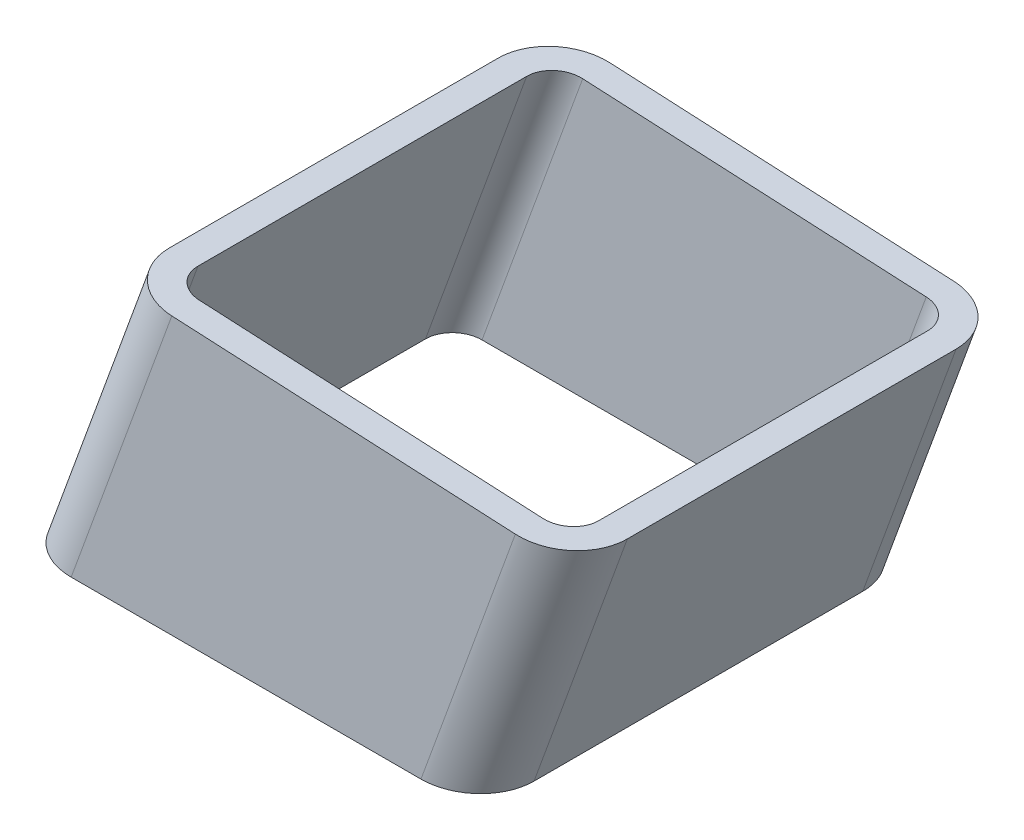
ISO-10303-21;
HEADER;
FILE_DESCRIPTION(('STEP AP214'),'2;1');
FILE_NAME('part.step','',(''),(''),'','','');
FILE_SCHEMA(('AUTOMOTIVE_DESIGN { 1 0 10303 214 1 1 1 1 }'));
ENDSEC;
DATA;
#1=APPLICATION_CONTEXT('core data for automotive mechanical design processes');
#2=APPLICATION_PROTOCOL_DEFINITION('international standard','automotive_design',2000,#1);
#3=PRODUCT_CONTEXT('',#1,'mechanical');
#4=PRODUCT('Part','Part','',(#3));
#5=PRODUCT_RELATED_PRODUCT_CATEGORY('part','',(#4));
#6=PRODUCT_DEFINITION_FORMATION('','',#4);
#7=PRODUCT_DEFINITION_CONTEXT('part definition',#1,'design');
#8=PRODUCT_DEFINITION('design','',#6,#7);
#9=PRODUCT_DEFINITION_SHAPE('','',#8);
#10=(LENGTH_UNIT() NAMED_UNIT(*) SI_UNIT(.MILLI.,.METRE.));
#11=(NAMED_UNIT(*) PLANE_ANGLE_UNIT() SI_UNIT($,.RADIAN.));
#12=(NAMED_UNIT(*) SI_UNIT($,.STERADIAN.) SOLID_ANGLE_UNIT());
#13=UNCERTAINTY_MEASURE_WITH_UNIT(LENGTH_MEASURE(1.E-05),#10,'distance_accuracy_value','');
#14=(GEOMETRIC_REPRESENTATION_CONTEXT(3) GLOBAL_UNCERTAINTY_ASSIGNED_CONTEXT((#13)) GLOBAL_UNIT_ASSIGNED_CONTEXT((#10,
#11,#12)) REPRESENTATION_CONTEXT('',''));
#15=CARTESIAN_POINT('',(0.,0.,0.));
#16=DIRECTION('',(0.,0.,1.));
#17=DIRECTION('',(1.,0.,0.));
#18=AXIS2_PLACEMENT_3D('',#15,#16,#17);
#19=CARTESIAN_POINT('',(5162.63263512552,168.764546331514,30.));
#20=DIRECTION('',(0.939692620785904,-0.34202014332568,0.));
#21=DIRECTION('',(0.34202014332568,0.939692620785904,0.));
#22=AXIS2_PLACEMENT_3D('',#19,#20,#21);
#23=PLANE('',#22);
#24=DIRECTION('',(0.,0.,-1.));
#25=VECTOR('',#24,1.);
#26=CARTESIAN_POINT('',(5121.95366701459,56.9999999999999,29.9999999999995));
#27=LINE('',#26,#25);
#28=CARTESIAN_POINT('',(5121.95366701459,57.,30.));
#29=VERTEX_POINT('',#28);
#30=CARTESIAN_POINT('',(5121.95366701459,57.0000000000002,-30.));
#31=VERTEX_POINT('',#30);
#32=EDGE_CURVE('E184',#29,#31,#27,.T.);
#33=ORIENTED_EDGE('',*,*,#32,.F.);
#34=DIRECTION('',(-0.34202014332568,-0.939692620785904,0.));
#35=VECTOR('',#34,1.);
#36=CARTESIAN_POINT('',(5162.63263512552,168.764546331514,30.));
#37=LINE('',#36,#35);
#38=CARTESIAN_POINT('',(5140.51986545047,108.010210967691,30.));
#39=VERTEX_POINT('',#38);
#40=EDGE_CURVE('E217',#39,#29,#37,.T.);
#41=ORIENTED_EDGE('',*,*,#40,.F.);
#42=DIRECTION('',(0.,0.,1.));
#43=VECTOR('',#42,1.);
#44=CARTESIAN_POINT('',(5140.51986545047,108.010210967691,30.));
#45=LINE('',#44,#43);
#46=CARTESIAN_POINT('',(5140.51986545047,108.010210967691,-30.));
#47=VERTEX_POINT('',#46);
#48=EDGE_CURVE('E227',#47,#39,#45,.T.);
#49=ORIENTED_EDGE('',*,*,#48,.F.);
#50=DIRECTION('',(-0.34202014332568,-0.939692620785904,0.));
#51=VECTOR('',#50,1.);
#52=CARTESIAN_POINT('',(5162.63263512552,168.764546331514,-30.));
#53=LINE('',#52,#51);
#54=EDGE_CURVE('E248',#47,#31,#53,.T.);
#55=ORIENTED_EDGE('',*,*,#54,.T.);
#56=EDGE_LOOP('',(#33,#41,#49,#55));
#57=FACE_BOUND('',#56,.T.);
#58=ADVANCED_FACE('F34',(#57),#23,.F.);
#59=CARTESIAN_POINT('',(5172.02956133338,165.344344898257,-30.));
#60=DIRECTION('',(-0.34202014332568,-0.939692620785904,0.));
#61=DIRECTION('',(0.939692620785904,-0.34202014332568,0.));
#62=AXIS2_PLACEMENT_3D('',#59,#60,#61);
#63=CYLINDRICAL_SURFACE('',#62,10.);
#64=CARTESIAN_POINT('',(5132.59544473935,57.0000000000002,-30.));
#65=DIRECTION('',(0.,-1.,0.));
#66=DIRECTION('',(-1.,0.,0.));
#67=AXIS2_PLACEMENT_3D('',#64,#65,#66);
#68=ELLIPSE('',#67,10.6417777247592,10.);
#69=CARTESIAN_POINT('',(5132.59544473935,57.0000000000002,-40.));
#70=VERTEX_POINT('',#69);
#71=EDGE_CURVE('E183',#31,#70,#68,.T.);
#72=ORIENTED_EDGE('',*,*,#71,.F.);
#73=ORIENTED_EDGE('',*,*,#54,.F.);
#74=CARTESIAN_POINT('',(5150.97118485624,107.48693103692,-30.));
#75=DIRECTION('',(0.0500056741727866,0.998748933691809,0.));
#76=DIRECTION('',(-0.998748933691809,0.0500056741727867,0.));
#77=AXIS2_PLACEMENT_3D('',#74,#75,#76);
#78=ELLIPSE('',#77,10.464411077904,10.);
#79=CARTESIAN_POINT('',(5150.97118485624,107.48693103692,-40.));
#80=VERTEX_POINT('',#79);
#81=EDGE_CURVE('E122',#80,#47,#78,.T.);
#82=ORIENTED_EDGE('',*,*,#81,.F.);
#83=DIRECTION('',(-0.34202014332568,-0.939692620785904,0.));
#84=VECTOR('',#83,1.);
#85=CARTESIAN_POINT('',(5172.02956133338,165.344344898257,-40.));
#86=LINE('',#85,#84);
#87=EDGE_CURVE('E245',#80,#70,#86,.T.);
#88=ORIENTED_EDGE('',*,*,#87,.T.);
#89=EDGE_LOOP('',(#72,#73,#82,#88));
#90=FACE_BOUND('',#89,.T.);
#91=ADVANCED_FACE('F308',(#90),#63,.T.);
#92=CARTESIAN_POINT('',(5228.41111858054,144.823136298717,-40.));
#93=DIRECTION('',(0.,0.,1.));
#94=DIRECTION('',(1.,0.,0.));
#95=AXIS2_PLACEMENT_3D('',#92,#93,#94);
#96=PLANE('',#95);
#97=DIRECTION('',(1.,0.,0.));
#98=VECTOR('',#97,1.);
#99=CARTESIAN_POINT('',(5228.41111858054,57.0000000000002,-40.));
#100=LINE('',#99,#98);
#101=CARTESIAN_POINT('',(5196.4461110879,57.0000000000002,-40.));
#102=VERTEX_POINT('',#101);
#103=EDGE_CURVE('E181',#70,#102,#100,.T.);
#104=ORIENTED_EDGE('',*,*,#103,.F.);
#105=ORIENTED_EDGE('',*,*,#87,.F.);
#106=DIRECTION('',(-0.998748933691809,0.0500056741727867,0.));
#107=VECTOR('',#106,1.);
#108=CARTESIAN_POINT('',(5226.35278845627,103.712701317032,-40.));
#109=LINE('',#108,#107);
#110=CARTESIAN_POINT('',(5213.67910129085,104.347251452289,-40.));
#111=VERTEX_POINT('',#110);
#112=EDGE_CURVE('E118',#111,#80,#109,.T.);
#113=ORIENTED_EDGE('',*,*,#112,.F.);
#114=DIRECTION('',(-0.34202014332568,-0.939692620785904,0.));
#115=VECTOR('',#114,1.);
#116=CARTESIAN_POINT('',(5228.41111858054,144.823136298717,-40.));
#117=LINE('',#116,#115);
#118=EDGE_CURVE('E242',#111,#102,#117,.T.);
#119=ORIENTED_EDGE('',*,*,#118,.T.);
#120=EDGE_LOOP('',(#104,#105,#113,#119));
#121=FACE_BOUND('',#120,.T.);
#122=ADVANCED_FACE('F306',(#121),#96,.F.);
#123=CARTESIAN_POINT('',(5228.41111858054,144.823136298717,-30.));
#124=DIRECTION('',(-0.34202014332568,-0.939692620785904,0.));
#125=DIRECTION('',(0.939692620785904,-0.34202014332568,0.));
#126=AXIS2_PLACEMENT_3D('',#123,#124,#125);
#127=CYLINDRICAL_SURFACE('',#126,10.);
#128=CARTESIAN_POINT('',(5196.4461110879,57.0000000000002,-30.));
#129=DIRECTION('',(0.,-1.,0.));
#130=DIRECTION('',(-1.,0.,0.));
#131=AXIS2_PLACEMENT_3D('',#128,#129,#130);
#132=ELLIPSE('',#131,10.6417777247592,10.);
#133=CARTESIAN_POINT('',(5207.08788881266,57.0000000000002,-30.));
#134=VERTEX_POINT('',#133);
#135=EDGE_CURVE('E179',#102,#134,#132,.T.);
#136=ORIENTED_EDGE('',*,*,#135,.F.);
#137=ORIENTED_EDGE('',*,*,#118,.F.);
#138=CARTESIAN_POINT('',(5213.67910129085,104.347251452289,-30.));
#139=DIRECTION('',(0.0500056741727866,0.998748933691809,0.));
#140=DIRECTION('',(-0.998748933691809,0.0500056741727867,0.));
#141=AXIS2_PLACEMENT_3D('',#138,#139,#140);
#142=ELLIPSE('',#141,10.464411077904,10.);
#143=CARTESIAN_POINT('',(5224.13042069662,103.823971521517,-30.));
#144=VERTEX_POINT('',#143);
#145=EDGE_CURVE('E223',#144,#111,#142,.T.);
#146=ORIENTED_EDGE('',*,*,#145,.F.);
#147=DIRECTION('',(-0.34202014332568,-0.939692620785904,0.));
#148=VECTOR('',#147,1.);
#149=CARTESIAN_POINT('',(5237.8080447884,141.402934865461,-30.));
#150=LINE('',#149,#148);
#151=EDGE_CURVE('E239',#144,#134,#150,.T.);
#152=ORIENTED_EDGE('',*,*,#151,.T.);
#153=EDGE_LOOP('',(#136,#137,#146,#152));
#154=FACE_BOUND('',#153,.T.);
#155=ADVANCED_FACE('F301',(#154),#127,.T.);
#156=CARTESIAN_POINT('',(5237.8080447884,141.402934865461,-30.));
#157=DIRECTION('',(-0.939692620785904,0.34202014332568,0.));
#158=DIRECTION('',(-0.34202014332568,-0.939692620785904,0.));
#159=AXIS2_PLACEMENT_3D('',#156,#157,#158);
#160=PLANE('',#159);
#161=DIRECTION('',(0.,0.,1.));
#162=VECTOR('',#161,1.);
#163=CARTESIAN_POINT('',(5207.08788881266,57.0000000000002,-30.0000000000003));
#164=LINE('',#163,#162);
#165=CARTESIAN_POINT('',(5207.08788881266,56.9999999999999,30.));
#166=VERTEX_POINT('',#165);
#167=EDGE_CURVE('E173',#134,#166,#164,.T.);
#168=ORIENTED_EDGE('',*,*,#167,.F.);
#169=ORIENTED_EDGE('',*,*,#151,.F.);
#170=DIRECTION('',(0.,0.,-1.));
#171=VECTOR('',#170,1.);
#172=CARTESIAN_POINT('',(5224.13042069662,103.823971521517,-30.));
#173=LINE('',#172,#171);
#174=CARTESIAN_POINT('',(5224.13042069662,103.823971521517,30.));
#175=VERTEX_POINT('',#174);
#176=EDGE_CURVE('E221',#175,#144,#173,.T.);
#177=ORIENTED_EDGE('',*,*,#176,.F.);
#178=DIRECTION('',(-0.34202014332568,-0.939692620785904,0.));
#179=VECTOR('',#178,1.);
#180=CARTESIAN_POINT('',(5237.8080447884,141.402934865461,30.));
#181=LINE('',#180,#179);
#182=EDGE_CURVE('E236',#175,#166,#181,.T.);
#183=ORIENTED_EDGE('',*,*,#182,.T.);
#184=EDGE_LOOP('',(#168,#169,#177,#183));
#185=FACE_BOUND('',#184,.T.);
#186=ADVANCED_FACE('F298',(#185),#160,.F.);
#187=CARTESIAN_POINT('',(5228.41111858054,144.823136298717,30.));
#188=DIRECTION('',(-0.34202014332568,-0.939692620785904,0.));
#189=DIRECTION('',(0.939692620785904,-0.34202014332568,0.));
#190=AXIS2_PLACEMENT_3D('',#187,#188,#189);
#191=CYLINDRICAL_SURFACE('',#190,10.);
#192=CARTESIAN_POINT('',(5196.4461110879,56.9999999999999,30.));
#193=DIRECTION('',(0.,-1.,0.));
#194=DIRECTION('',(-1.,0.,0.));
#195=AXIS2_PLACEMENT_3D('',#192,#193,#194);
#196=ELLIPSE('',#195,10.6417777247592,10.);
#197=CARTESIAN_POINT('',(5196.4461110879,56.9999999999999,40.));
#198=VERTEX_POINT('',#197);
#199=EDGE_CURVE('E171',#166,#198,#196,.T.);
#200=ORIENTED_EDGE('',*,*,#199,.F.);
#201=ORIENTED_EDGE('',*,*,#182,.F.);
#202=CARTESIAN_POINT('',(5213.67910129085,104.347251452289,30.));
#203=DIRECTION('',(0.0500056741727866,0.998748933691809,0.));
#204=DIRECTION('',(-0.998748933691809,0.0500056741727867,0.));
#205=AXIS2_PLACEMENT_3D('',#202,#203,#204);
#206=ELLIPSE('',#205,10.464411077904,10.);
#207=CARTESIAN_POINT('',(5213.67910129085,104.347251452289,40.));
#208=VERTEX_POINT('',#207);
#209=EDGE_CURVE('E219',#208,#175,#206,.T.);
#210=ORIENTED_EDGE('',*,*,#209,.F.);
#211=DIRECTION('',(-0.34202014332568,-0.939692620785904,0.));
#212=VECTOR('',#211,1.);
#213=CARTESIAN_POINT('',(5228.41111858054,144.823136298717,40.));
#214=LINE('',#213,#212);
#215=EDGE_CURVE('E233',#208,#198,#214,.T.);
#216=ORIENTED_EDGE('',*,*,#215,.T.);
#217=EDGE_LOOP('',(#200,#201,#210,#216));
#218=FACE_BOUND('',#217,.T.);
#219=ADVANCED_FACE('F291',(#218),#191,.T.);
#220=CARTESIAN_POINT('',(5172.02956133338,165.344344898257,40.));
#221=DIRECTION('',(0.,0.,-1.));
#222=DIRECTION('',(-1.,0.,0.));
#223=AXIS2_PLACEMENT_3D('',#220,#221,#222);
#224=PLANE('',#223);
#225=DIRECTION('',(-1.,0.,0.));
#226=VECTOR('',#225,1.);
#227=CARTESIAN_POINT('',(5172.02956133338,56.9999999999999,40.));
#228=LINE('',#227,#226);
#229=CARTESIAN_POINT('',(5132.59544473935,56.9999999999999,40.));
#230=VERTEX_POINT('',#229);
#231=EDGE_CURVE('E53',#198,#230,#228,.T.);
#232=ORIENTED_EDGE('',*,*,#231,.F.);
#233=ORIENTED_EDGE('',*,*,#215,.F.);
#234=DIRECTION('',(0.998748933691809,-0.0500056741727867,0.));
#235=VECTOR('',#234,1.);
#236=CARTESIAN_POINT('',(5169.08732404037,106.579886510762,40.));
#237=LINE('',#236,#235);
#238=CARTESIAN_POINT('',(5150.97118485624,107.486931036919,40.));
#239=VERTEX_POINT('',#238);
#240=EDGE_CURVE('E216',#239,#208,#237,.T.);
#241=ORIENTED_EDGE('',*,*,#240,.F.);
#242=DIRECTION('',(-0.34202014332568,-0.939692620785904,0.));
#243=VECTOR('',#242,1.);
#244=CARTESIAN_POINT('',(5172.02956133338,165.344344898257,40.));
#245=LINE('',#244,#243);
#246=EDGE_CURVE('E230',#239,#230,#245,.T.);
#247=ORIENTED_EDGE('',*,*,#246,.T.);
#248=EDGE_LOOP('',(#232,#233,#241,#247));
#249=FACE_BOUND('',#248,.T.);
#250=ADVANCED_FACE('F288',(#249),#224,.F.);
#251=CARTESIAN_POINT('',(5172.02956133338,165.344344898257,30.));
#252=DIRECTION('',(-0.34202014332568,-0.939692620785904,0.));
#253=DIRECTION('',(0.939692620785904,-0.34202014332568,0.));
#254=AXIS2_PLACEMENT_3D('',#251,#252,#253);
#255=CYLINDRICAL_SURFACE('',#254,10.);
#256=CARTESIAN_POINT('',(5132.59544473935,56.9999999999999,30.));
#257=DIRECTION('',(0.,-1.,0.));
#258=DIRECTION('',(-1.,0.,0.));
#259=AXIS2_PLACEMENT_3D('',#256,#257,#258);
#260=ELLIPSE('',#259,10.6417777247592,10.);
#261=EDGE_CURVE('E176',#230,#29,#260,.T.);
#262=ORIENTED_EDGE('',*,*,#261,.F.);
#263=ORIENTED_EDGE('',*,*,#246,.F.);
#264=CARTESIAN_POINT('',(5150.97118485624,107.48693103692,30.));
#265=DIRECTION('',(0.0500056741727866,0.998748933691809,0.));
#266=DIRECTION('',(-0.998748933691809,0.0500056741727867,0.));
#267=AXIS2_PLACEMENT_3D('',#264,#265,#266);
#268=ELLIPSE('',#267,10.464411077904,10.);
#269=EDGE_CURVE('E214',#39,#239,#268,.T.);
#270=ORIENTED_EDGE('',*,*,#269,.F.);
#271=ORIENTED_EDGE('',*,*,#40,.T.);
#272=EDGE_LOOP('',(#262,#263,#270,#271));
#273=FACE_BOUND('',#272,.T.);
#274=ADVANCED_FACE('F36',(#273),#255,.T.);
#275=CARTESIAN_POINT('',(6158.08276398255,57.0625533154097,-40.));
#276=DIRECTION('',(0.0500056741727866,0.998748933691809,0.));
#277=DIRECTION('',(-0.998748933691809,0.0500056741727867,0.));
#278=AXIS2_PLACEMENT_3D('',#275,#276,#277);
#279=PLANE('',#278);
#280=DIRECTION('',(0.998748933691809,-0.0500056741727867,0.));
#281=VECTOR('',#280,1.);
#282=CARTESIAN_POINT('',(5169.08732404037,106.579886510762,35.));
#283=LINE('',#282,#281);
#284=CARTESIAN_POINT('',(5150.97118485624,107.48693103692,35.));
#285=VERTEX_POINT('',#284);
#286=CARTESIAN_POINT('',(5213.67910129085,104.347251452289,35.));
#287=VERTEX_POINT('',#286);
#288=EDGE_CURVE('E186',#285,#287,#283,.T.);
#289=ORIENTED_EDGE('',*,*,#288,.F.);
#290=CARTESIAN_POINT('',(5150.97118485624,107.48693103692,30.));
#291=DIRECTION('',(0.0500056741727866,0.998748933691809,0.));
#292=DIRECTION('',(-0.998748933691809,0.0500056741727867,0.));
#293=AXIS2_PLACEMENT_3D('',#290,#291,#292);
#294=ELLIPSE('',#293,5.232205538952,5.00000000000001);
#295=CARTESIAN_POINT('',(5145.74552515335,107.748571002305,30.));
#296=VERTEX_POINT('',#295);
#297=EDGE_CURVE('E191',#296,#285,#294,.T.);
#298=ORIENTED_EDGE('',*,*,#297,.F.);
#299=DIRECTION('',(0.,0.,1.));
#300=VECTOR('',#299,1.);
#301=CARTESIAN_POINT('',(5145.74552515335,107.748571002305,30.));
#302=LINE('',#301,#300);
#303=CARTESIAN_POINT('',(5145.74552515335,107.748571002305,-30.));
#304=VERTEX_POINT('',#303);
#305=EDGE_CURVE('E196',#304,#296,#302,.T.);
#306=ORIENTED_EDGE('',*,*,#305,.F.);
#307=CARTESIAN_POINT('',(5150.97118485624,107.48693103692,-30.));
#308=DIRECTION('',(0.0500056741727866,0.998748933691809,0.));
#309=DIRECTION('',(-0.998748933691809,0.0500056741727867,0.));
#310=AXIS2_PLACEMENT_3D('',#307,#308,#309);
#311=ELLIPSE('',#310,5.232205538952,5.00000000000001);
#312=CARTESIAN_POINT('',(5150.97118485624,107.486931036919,-35.));
#313=VERTEX_POINT('',#312);
#314=EDGE_CURVE('E201',#313,#304,#311,.T.);
#315=ORIENTED_EDGE('',*,*,#314,.F.);
#316=DIRECTION('',(-0.998748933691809,0.0500056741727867,0.));
#317=VECTOR('',#316,1.);
#318=CARTESIAN_POINT('',(5226.35278845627,103.712701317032,-35.));
#319=LINE('',#318,#317);
#320=CARTESIAN_POINT('',(5213.67910129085,104.347251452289,-35.));
#321=VERTEX_POINT('',#320);
#322=EDGE_CURVE('E206',#321,#313,#319,.T.);
#323=ORIENTED_EDGE('',*,*,#322,.F.);
#324=CARTESIAN_POINT('',(5213.67910129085,104.347251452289,-30.));
#325=DIRECTION('',(0.0500056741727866,0.998748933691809,0.));
#326=DIRECTION('',(-0.998748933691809,0.0500056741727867,0.));
#327=AXIS2_PLACEMENT_3D('',#324,#325,#326);
#328=ELLIPSE('',#327,5.23220553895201,5.00000000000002);
#329=CARTESIAN_POINT('',(5218.90476099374,104.085611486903,-30.));
#330=VERTEX_POINT('',#329);
#331=EDGE_CURVE('E167',#330,#321,#328,.T.);
#332=ORIENTED_EDGE('',*,*,#331,.F.);
#333=DIRECTION('',(0.,0.,-1.));
#334=VECTOR('',#333,1.);
#335=CARTESIAN_POINT('',(5218.90476099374,104.085611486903,-30.));
#336=LINE('',#335,#334);
#337=CARTESIAN_POINT('',(5218.90476099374,104.085611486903,30.));
#338=VERTEX_POINT('',#337);
#339=EDGE_CURVE('E158',#338,#330,#336,.T.);
#340=ORIENTED_EDGE('',*,*,#339,.F.);
#341=CARTESIAN_POINT('',(5213.67910129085,104.347251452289,30.));
#342=DIRECTION('',(0.0500056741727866,0.998748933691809,0.));
#343=DIRECTION('',(-0.998748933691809,0.0500056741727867,0.));
#344=AXIS2_PLACEMENT_3D('',#341,#342,#343);
#345=ELLIPSE('',#344,5.23220553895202,5.00000000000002);
#346=EDGE_CURVE('E11',#287,#338,#345,.T.);
#347=ORIENTED_EDGE('',*,*,#346,.F.);
#348=EDGE_LOOP('',(#289,#298,#306,#315,#323,#332,#340,#347));
#349=FACE_BOUND('',#348,.T.);
#350=ORIENTED_EDGE('',*,*,#269,.T.);
#351=ORIENTED_EDGE('',*,*,#240,.T.);
#352=ORIENTED_EDGE('',*,*,#209,.T.);
#353=ORIENTED_EDGE('',*,*,#176,.T.);
#354=ORIENTED_EDGE('',*,*,#145,.T.);
#355=ORIENTED_EDGE('',*,*,#112,.T.);
#356=ORIENTED_EDGE('',*,*,#81,.T.);
#357=ORIENTED_EDGE('',*,*,#48,.T.);
#358=EDGE_LOOP('',(#350,#351,#352,#353,#354,#355,#356,#357));
#359=FACE_BOUND('',#358,.T.);
#360=ADVANCED_FACE('F284',(#349,#359),#279,.T.);
#361=CARTESIAN_POINT('',(9149.96897120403,57.0000000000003,-59.9999999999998));
#362=DIRECTION('',(0.,-1.,0.));
#363=DIRECTION('',(0.,0.,-1.));
#364=AXIS2_PLACEMENT_3D('',#361,#362,#363);
#365=PLANE('',#364);
#366=DIRECTION('',(0.,0.,1.));
#367=VECTOR('',#366,1.);
#368=CARTESIAN_POINT('',(5201.76699995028,57.0000000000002,-30.0000000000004));
#369=LINE('',#368,#367);
#370=CARTESIAN_POINT('',(5201.76699995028,57.0000000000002,-30.));
#371=VERTEX_POINT('',#370);
#372=CARTESIAN_POINT('',(5201.76699995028,57.0000000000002,30.));
#373=VERTEX_POINT('',#372);
#374=EDGE_CURVE('E151',#371,#373,#369,.T.);
#375=ORIENTED_EDGE('',*,*,#374,.F.);
#376=CARTESIAN_POINT('',(5196.4461110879,57.0000000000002,-30.));
#377=DIRECTION('',(0.,-1.,0.));
#378=DIRECTION('',(-1.,0.,0.));
#379=AXIS2_PLACEMENT_3D('',#376,#377,#378);
#380=ELLIPSE('',#379,5.3208888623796,5.00000000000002);
#381=CARTESIAN_POINT('',(5196.4461110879,57.0000000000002,-35.));
#382=VERTEX_POINT('',#381);
#383=EDGE_CURVE('E147',#382,#371,#380,.T.);
#384=ORIENTED_EDGE('',*,*,#383,.F.);
#385=DIRECTION('',(1.,0.,0.));
#386=VECTOR('',#385,1.);
#387=CARTESIAN_POINT('',(5228.41111858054,57.0000000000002,-35.));
#388=LINE('',#387,#386);
#389=CARTESIAN_POINT('',(5132.59544473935,57.0000000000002,-35.));
#390=VERTEX_POINT('',#389);
#391=EDGE_CURVE('E210',#390,#382,#388,.T.);
#392=ORIENTED_EDGE('',*,*,#391,.F.);
#393=CARTESIAN_POINT('',(5132.59544473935,57.0000000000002,-30.));
#394=DIRECTION('',(0.,-1.,0.));
#395=DIRECTION('',(-1.,0.,0.));
#396=AXIS2_PLACEMENT_3D('',#393,#394,#395);
#397=ELLIPSE('',#396,5.32088886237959,5.00000000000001);
#398=CARTESIAN_POINT('',(5127.27455587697,57.0000000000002,-30.));
#399=VERTEX_POINT('',#398);
#400=EDGE_CURVE('E205',#399,#390,#397,.T.);
#401=ORIENTED_EDGE('',*,*,#400,.F.);
#402=DIRECTION('',(0.,0.,-1.));
#403=VECTOR('',#402,1.);
#404=CARTESIAN_POINT('',(5127.27455587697,56.9999999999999,29.9999999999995));
#405=LINE('',#404,#403);
#406=CARTESIAN_POINT('',(5127.27455587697,56.9999999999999,30.));
#407=VERTEX_POINT('',#406);
#408=EDGE_CURVE('E200',#407,#399,#405,.T.);
#409=ORIENTED_EDGE('',*,*,#408,.F.);
#410=CARTESIAN_POINT('',(5132.59544473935,56.9999999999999,30.));
#411=DIRECTION('',(0.,-1.,0.));
#412=DIRECTION('',(-1.,0.,0.));
#413=AXIS2_PLACEMENT_3D('',#410,#411,#412);
#414=ELLIPSE('',#413,5.32088886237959,5.00000000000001);
#415=CARTESIAN_POINT('',(5132.59544473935,56.9999999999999,35.));
#416=VERTEX_POINT('',#415);
#417=EDGE_CURVE('E195',#416,#407,#414,.T.);
#418=ORIENTED_EDGE('',*,*,#417,.F.);
#419=DIRECTION('',(-1.,0.,0.));
#420=VECTOR('',#419,1.);
#421=CARTESIAN_POINT('',(5172.02956133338,56.9999999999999,35.));
#422=LINE('',#421,#420);
#423=CARTESIAN_POINT('',(5196.4461110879,56.9999999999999,35.));
#424=VERTEX_POINT('',#423);
#425=EDGE_CURVE('E190',#424,#416,#422,.T.);
#426=ORIENTED_EDGE('',*,*,#425,.F.);
#427=CARTESIAN_POINT('',(5196.4461110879,56.9999999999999,30.));
#428=DIRECTION('',(0.,-1.,0.));
#429=DIRECTION('',(-1.,0.,0.));
#430=AXIS2_PLACEMENT_3D('',#427,#428,#429);
#431=ELLIPSE('',#430,5.32088886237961,5.00000000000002);
#432=EDGE_CURVE('E44',#373,#424,#431,.T.);
#433=ORIENTED_EDGE('',*,*,#432,.F.);
#434=EDGE_LOOP('',(#375,#384,#392,#401,#409,#418,#426,#433));
#435=FACE_BOUND('',#434,.T.);
#436=ORIENTED_EDGE('',*,*,#261,.T.);
#437=ORIENTED_EDGE('',*,*,#32,.T.);
#438=ORIENTED_EDGE('',*,*,#71,.T.);
#439=ORIENTED_EDGE('',*,*,#103,.T.);
#440=ORIENTED_EDGE('',*,*,#135,.T.);
#441=ORIENTED_EDGE('',*,*,#167,.T.);
#442=ORIENTED_EDGE('',*,*,#199,.T.);
#443=ORIENTED_EDGE('',*,*,#231,.T.);
#444=EDGE_LOOP('',(#436,#437,#438,#439,#440,#441,#442,#443));
#445=FACE_BOUND('',#444,.T.);
#446=ADVANCED_FACE('F152',(#435,#445),#365,.T.);
#447=CARTESIAN_POINT('',(5233.10958168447,143.113035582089,-30.));
#448=DIRECTION('',(-0.939692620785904,0.34202014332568,0.));
#449=DIRECTION('',(-0.34202014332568,-0.939692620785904,0.));
#450=AXIS2_PLACEMENT_3D('',#447,#448,#449);
#451=PLANE('',#450);
#452=DIRECTION('',(-0.34202014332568,-0.939692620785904,0.));
#453=VECTOR('',#452,1.);
#454=CARTESIAN_POINT('',(5233.10958168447,143.113035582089,-30.));
#455=LINE('',#454,#453);
#456=EDGE_CURVE('E38',#330,#371,#455,.T.);
#457=ORIENTED_EDGE('',*,*,#456,.T.);
#458=ORIENTED_EDGE('',*,*,#374,.T.);
#459=DIRECTION('',(-0.34202014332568,-0.939692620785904,0.));
#460=VECTOR('',#459,1.);
#461=CARTESIAN_POINT('',(5233.10958168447,143.113035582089,30.));
#462=LINE('',#461,#460);
#463=EDGE_CURVE('E189',#338,#373,#462,.T.);
#464=ORIENTED_EDGE('',*,*,#463,.F.);
#465=ORIENTED_EDGE('',*,*,#339,.T.);
#466=EDGE_LOOP('',(#457,#458,#464,#465));
#467=FACE_BOUND('',#466,.T.);
#468=ADVANCED_FACE('F170',(#467),#451,.T.);
#469=CARTESIAN_POINT('',(5228.41111858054,144.823136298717,-30.));
#470=DIRECTION('',(-0.34202014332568,-0.939692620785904,0.));
#471=DIRECTION('',(0.939692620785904,-0.34202014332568,0.));
#472=AXIS2_PLACEMENT_3D('',#469,#470,#471);
#473=CYLINDRICAL_SURFACE('',#472,5.00000000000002);
#474=DIRECTION('',(-0.34202014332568,-0.939692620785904,0.));
#475=VECTOR('',#474,1.);
#476=CARTESIAN_POINT('',(5228.41111858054,144.823136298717,-35.));
#477=LINE('',#476,#475);
#478=EDGE_CURVE('E166',#321,#382,#477,.T.);
#479=ORIENTED_EDGE('',*,*,#478,.T.);
#480=ORIENTED_EDGE('',*,*,#383,.T.);
#481=ORIENTED_EDGE('',*,*,#456,.F.);
#482=ORIENTED_EDGE('',*,*,#331,.T.);
#483=EDGE_LOOP('',(#479,#480,#481,#482));
#484=FACE_BOUND('',#483,.T.);
#485=ADVANCED_FACE('F163',(#484),#473,.F.);
#486=CARTESIAN_POINT('',(5228.41111858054,144.823136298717,-35.));
#487=DIRECTION('',(0.,0.,1.));
#488=DIRECTION('',(1.,0.,0.));
#489=AXIS2_PLACEMENT_3D('',#486,#487,#488);
#490=PLANE('',#489);
#491=DIRECTION('',(-0.34202014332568,-0.939692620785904,0.));
#492=VECTOR('',#491,1.);
#493=CARTESIAN_POINT('',(5172.02956133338,165.344344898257,-35.));
#494=LINE('',#493,#492);
#495=EDGE_CURVE('E212',#313,#390,#494,.T.);
#496=ORIENTED_EDGE('',*,*,#495,.T.);
#497=ORIENTED_EDGE('',*,*,#391,.T.);
#498=ORIENTED_EDGE('',*,*,#478,.F.);
#499=ORIENTED_EDGE('',*,*,#322,.T.);
#500=EDGE_LOOP('',(#496,#497,#498,#499));
#501=FACE_BOUND('',#500,.T.);
#502=ADVANCED_FACE('F342',(#501),#490,.T.);
#503=CARTESIAN_POINT('',(5172.02956133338,165.344344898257,-30.));
#504=DIRECTION('',(-0.34202014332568,-0.939692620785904,0.));
#505=DIRECTION('',(0.939692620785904,-0.34202014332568,0.));
#506=AXIS2_PLACEMENT_3D('',#503,#504,#505);
#507=CYLINDRICAL_SURFACE('',#506,5.00000000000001);
#508=DIRECTION('',(-0.34202014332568,-0.939692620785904,0.));
#509=VECTOR('',#508,1.);
#510=CARTESIAN_POINT('',(5167.33109822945,167.054445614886,-30.));
#511=LINE('',#510,#509);
#512=EDGE_CURVE('E209',#304,#399,#511,.T.);
#513=ORIENTED_EDGE('',*,*,#512,.T.);
#514=ORIENTED_EDGE('',*,*,#400,.T.);
#515=ORIENTED_EDGE('',*,*,#495,.F.);
#516=ORIENTED_EDGE('',*,*,#314,.T.);
#517=EDGE_LOOP('',(#513,#514,#515,#516));
#518=FACE_BOUND('',#517,.T.);
#519=ADVANCED_FACE('F345',(#518),#507,.F.);
#520=CARTESIAN_POINT('',(5167.33109822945,167.054445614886,30.));
#521=DIRECTION('',(0.939692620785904,-0.34202014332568,0.));
#522=DIRECTION('',(0.34202014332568,0.939692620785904,0.));
#523=AXIS2_PLACEMENT_3D('',#520,#521,#522);
#524=PLANE('',#523);
#525=DIRECTION('',(-0.34202014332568,-0.939692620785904,0.));
#526=VECTOR('',#525,1.);
#527=CARTESIAN_POINT('',(5167.33109822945,167.054445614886,30.));
#528=LINE('',#527,#526);
#529=EDGE_CURVE('E204',#296,#407,#528,.T.);
#530=ORIENTED_EDGE('',*,*,#529,.T.);
#531=ORIENTED_EDGE('',*,*,#408,.T.);
#532=ORIENTED_EDGE('',*,*,#512,.F.);
#533=ORIENTED_EDGE('',*,*,#305,.T.);
#534=EDGE_LOOP('',(#530,#531,#532,#533));
#535=FACE_BOUND('',#534,.T.);
#536=ADVANCED_FACE('F348',(#535),#524,.T.);
#537=CARTESIAN_POINT('',(5172.02956133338,165.344344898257,30.));
#538=DIRECTION('',(-0.34202014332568,-0.939692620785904,0.));
#539=DIRECTION('',(0.939692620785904,-0.34202014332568,0.));
#540=AXIS2_PLACEMENT_3D('',#537,#538,#539);
#541=CYLINDRICAL_SURFACE('',#540,5.00000000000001);
#542=DIRECTION('',(-0.34202014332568,-0.939692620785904,0.));
#543=VECTOR('',#542,1.);
#544=CARTESIAN_POINT('',(5172.02956133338,165.344344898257,35.));
#545=LINE('',#544,#543);
#546=EDGE_CURVE('E199',#285,#416,#545,.T.);
#547=ORIENTED_EDGE('',*,*,#546,.T.);
#548=ORIENTED_EDGE('',*,*,#417,.T.);
#549=ORIENTED_EDGE('',*,*,#529,.F.);
#550=ORIENTED_EDGE('',*,*,#297,.T.);
#551=EDGE_LOOP('',(#547,#548,#549,#550));
#552=FACE_BOUND('',#551,.T.);
#553=ADVANCED_FACE('F352',(#552),#541,.F.);
#554=CARTESIAN_POINT('',(5172.02956133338,165.344344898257,35.));
#555=DIRECTION('',(0.,0.,-1.));
#556=DIRECTION('',(-1.,0.,0.));
#557=AXIS2_PLACEMENT_3D('',#554,#555,#556);
#558=PLANE('',#557);
#559=DIRECTION('',(-0.34202014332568,-0.939692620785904,0.));
#560=VECTOR('',#559,1.);
#561=CARTESIAN_POINT('',(5228.41111858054,144.823136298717,35.));
#562=LINE('',#561,#560);
#563=EDGE_CURVE('E194',#287,#424,#562,.T.);
#564=ORIENTED_EDGE('',*,*,#563,.T.);
#565=ORIENTED_EDGE('',*,*,#425,.T.);
#566=ORIENTED_EDGE('',*,*,#546,.F.);
#567=ORIENTED_EDGE('',*,*,#288,.T.);
#568=EDGE_LOOP('',(#564,#565,#566,#567));
#569=FACE_BOUND('',#568,.T.);
#570=ADVANCED_FACE('F356',(#569),#558,.T.);
#571=CARTESIAN_POINT('',(5228.41111858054,144.823136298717,30.));
#572=DIRECTION('',(-0.34202014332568,-0.939692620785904,0.));
#573=DIRECTION('',(0.939692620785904,-0.34202014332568,0.));
#574=AXIS2_PLACEMENT_3D('',#571,#572,#573);
#575=CYLINDRICAL_SURFACE('',#574,5.00000000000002);
#576=ORIENTED_EDGE('',*,*,#463,.T.);
#577=ORIENTED_EDGE('',*,*,#432,.T.);
#578=ORIENTED_EDGE('',*,*,#563,.F.);
#579=ORIENTED_EDGE('',*,*,#346,.T.);
#580=EDGE_LOOP('',(#576,#577,#578,#579));
#581=FACE_BOUND('',#580,.T.);
#582=ADVANCED_FACE('F359',(#581),#575,.F.);
#583=CLOSED_SHELL('',(#58,#91,#122,#155,#186,#219,#250,#274,#360,#446,#468,#485,#502,#519,#536,
#553,#570,#582));
#584=MANIFOLD_SOLID_BREP('B2',#583);
#585=ADVANCED_BREP_SHAPE_REPRESENTATION('',(#18,#584),#14);
#586=SHAPE_DEFINITION_REPRESENTATION(#9,#585);
ENDSEC;
END-ISO-10303-21;
